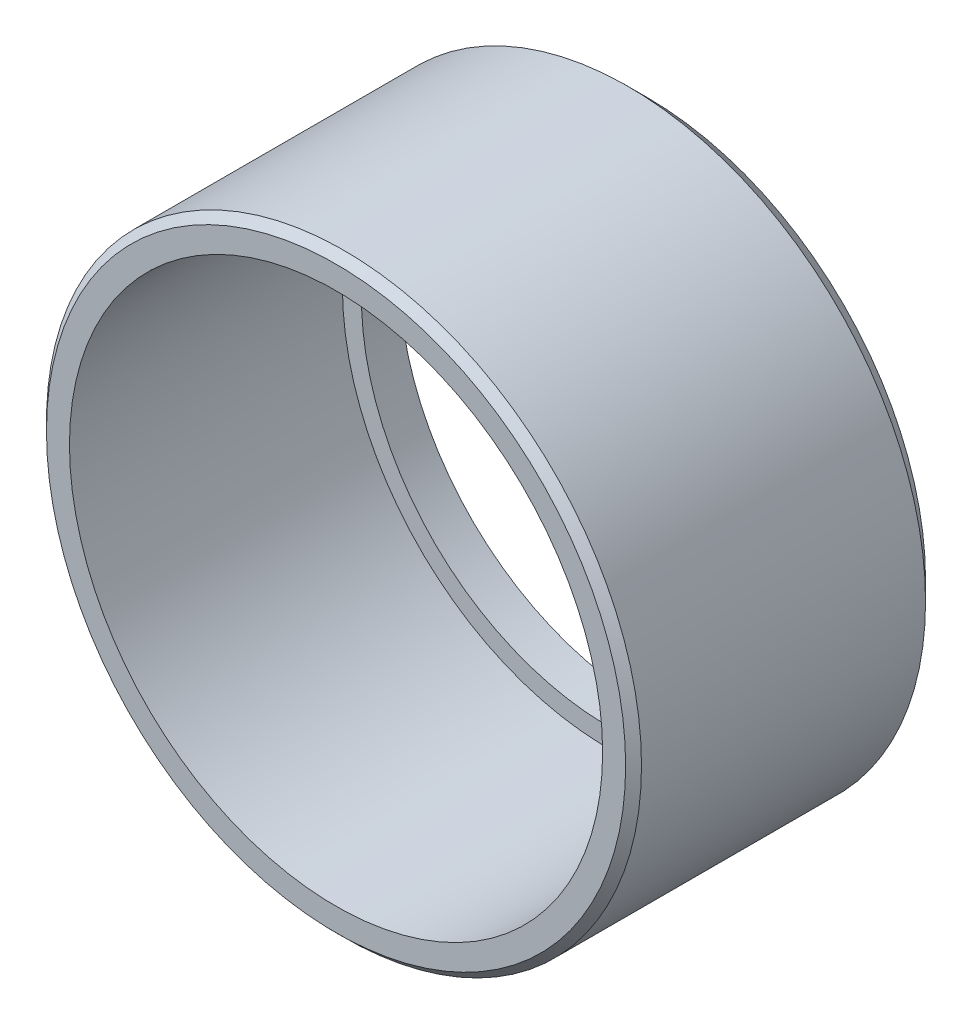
from build123d import *

# Parameters (mm, degrees)
SKETCH1_R      = 47.625
SKETCH1_R_2    = 39.624
EXTRUDE1_DEPTH = 49.784
SKETCH2_R      = 42.672
EXTRUDE2_DEPTH = 43.688
CHAMFER1_SIZE  = 3.048
CHAMFER2_SIZE  = 1.27


with BuildPart() as part:
    # Sketch1 → Extrude1 (new body)
    with BuildSketch(Plane.XY):
        Circle(SKETCH1_R)
        Circle(SKETCH1_R_2, mode=Mode.SUBTRACT)
    extrude(amount=EXTRUDE1_DEPTH)

    # Sketch2 → Extrude2 (cut)
    with BuildSketch(Plane.XY.offset(49.784)):
        Circle(SKETCH2_R)
    extrude(amount=-EXTRUDE2_DEPTH, mode=Mode.SUBTRACT)

    # Chamfer1
    chamfer1_edges = [part.edges().sort_by_distance(p)[0] for p in [
        (-47.625, 0, 0),
    ]]
    chamfer(chamfer1_edges, length=CHAMFER1_SIZE)

    # Chamfer2
    chamfer2_edges = [part.edges().sort_by_distance(p)[0] for p in [
        (-47.625, 0, 49.784),
    ]]
    chamfer(chamfer2_edges, length=CHAMFER2_SIZE)


solid = part.part
